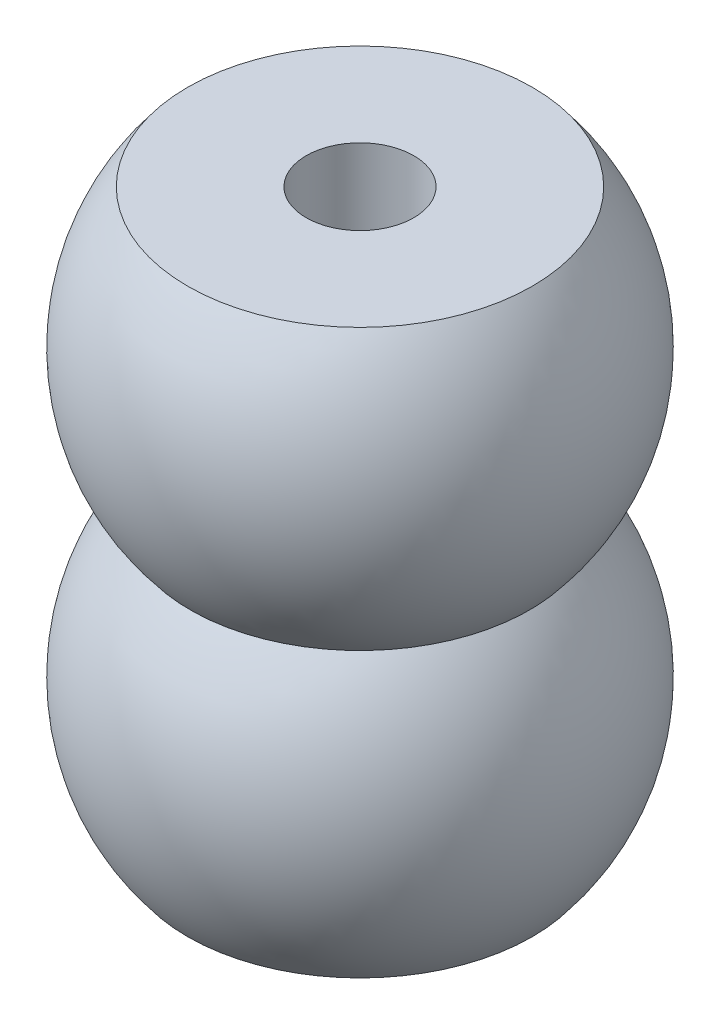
from build123d import *


with BuildPart() as part:
    # Esquisse1 → Base-R_volution (revolve)
    with BuildSketch(Plane.XY):
        with BuildLine():
            Line((-27.221315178, 89), (-8.5, 89))
            Line((-8.5, 89), (-8.5, 0))
            Line((-8.5, 0), (-27.221315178, 0))
            ThreePointArc((-27.221315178, 0), (-34.998501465, 22.323875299), (-26.809513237, 44.5))
            ThreePointArc((-26.809513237, 44.5), (-34.998501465, 66.676124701), (-27.221315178, 89))
        make_face()
    revolve(axis=Axis((0, -3.077632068, 0), (0, 1, 0)))


solid = part.part
